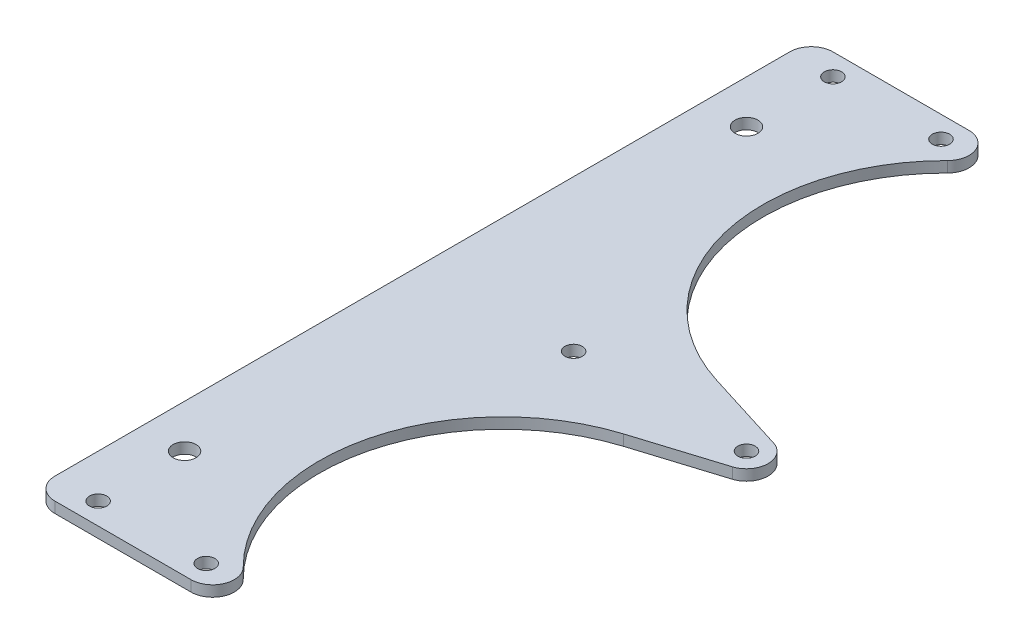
from build123d import *

# Parameters (mm, degrees)
BOSS_EXTRUDE1_DEPTH              = 3.175
F_7_0_201_DIAMETER_HOLE1_D       = 5.1054
F_17_64_0_26563_DIAMETER_HOLE1_D = 6.747002


with BuildPart() as part:
    # Sketch1 → Boss-Extrude1 (new body)
    with BuildSketch(Plane(origin=(0, 0, 0), x_dir=(1, 0, 0), z_dir=(0, 1, 0))):
        with BuildLine():
            Line((0, 6.35), (0, 222.25))
            ThreePointArc((0, 222.25), (1.859871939, 226.740128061), (6.35, 228.6))
            Line((6.35, 228.6), (46.348724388, 228.6))
            ThreePointArc((46.348724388, 228.6), (52.218340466, 224.672830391), (50.827806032, 217.748852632))
            ThreePointArc((50.827806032, 217.748852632), (36.471727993, 166.660346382), (72.795266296, 127.972712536))
            Line((72.795266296, 127.972712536), (97.144674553, 120.360751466))
            ThreePointArc((97.144674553, 120.360751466), (101.6, 114.3), (97.144674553, 108.239248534))
            Line((97.144674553, 108.239248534), (72.795266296, 100.627287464))
            ThreePointArc((72.795266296, 100.627287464), (36.471727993, 61.939653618), (50.827806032, 10.851147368))
            ThreePointArc((50.827806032, 10.851147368), (52.218340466, 3.927169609), (46.348724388, 0))
            Line((46.348724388, 0), (6.35, 0))
            ThreePointArc((6.35, 0), (1.859871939, 1.859871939), (0, 6.35))
        make_face()
    extrude(amount=BOSS_EXTRUDE1_DEPTH)

    # 7 _0.201_ Diameter Hole1 (through all)
    with Locations(Plane(origin=(0, 3.175, 0), x_dir=(1, 0, 0), z_dir=(0, 1, 0))):
        with Locations((95.25, 114.3), (44.45, 114.3), (12.7, 222.25), (12.7, 6.35), (12.7, 31.75), (12.7, 196.85), (44.45, 6.35), (44.45, 222.25)):
            Hole(F_7_0_201_DIAMETER_HOLE1_D / 2)

    # 17_64 _0.26563_ Diameter Hole1 (through all)
    with Locations(Plane(origin=(0, 3.175, 0), x_dir=(1, 0, 0), z_dir=(0, 1, 0))):
        with Locations((12.7, 196.85), (12.7, 31.75)):
            Hole(F_17_64_0_26563_DIAMETER_HOLE1_D / 2)


solid = part.part
